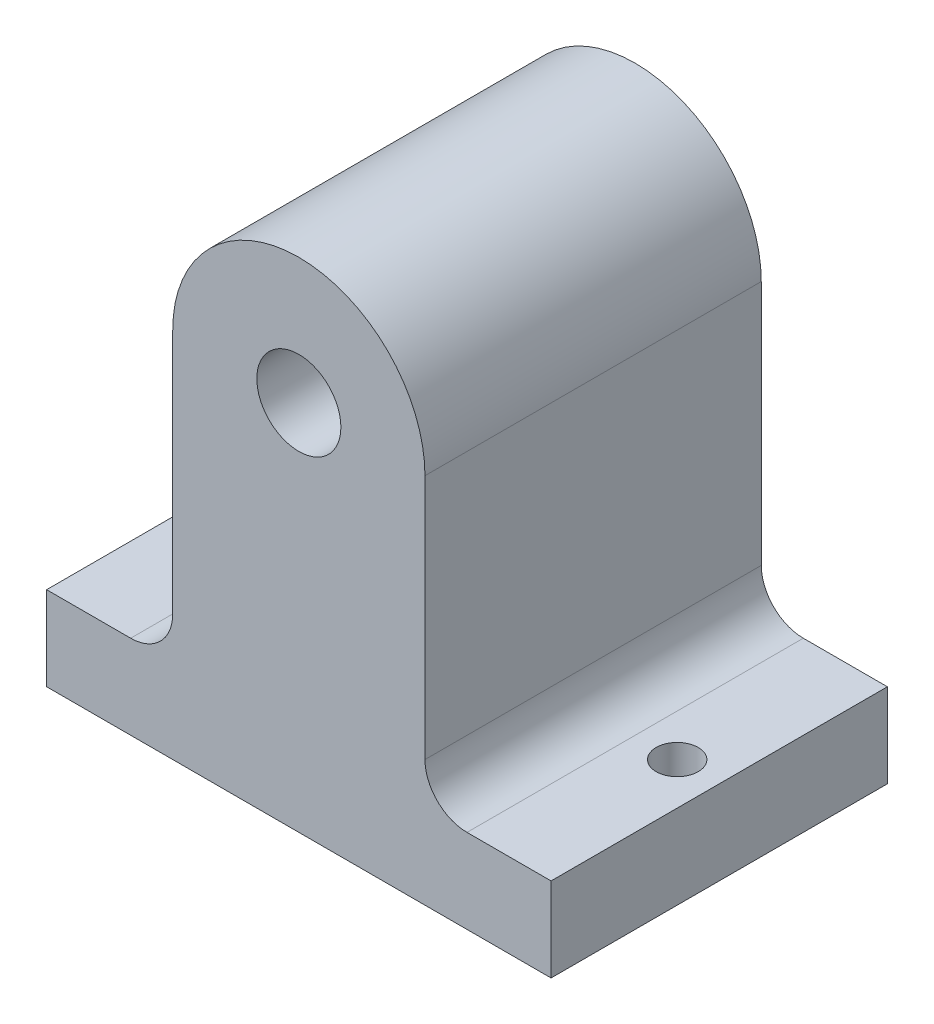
from build123d import *

# Parameters (mm, degrees)
SKETCH1_R           = 9.525
SKETCH1_R_2         = 3.175
SKETCH1_W           = 19.05
SKETCH1_H           = 6.35
SKETCH1_W_2         = 9.525
BOSS_EXTRUDE1_DEPTH = 25.4
FILLET1_R           = 3.175
SKETCH2_R           = 1.5875
CUT_EXTRUDE1_DEPTH  = 25.4


with BuildPart() as part:
    # Sketch1 → Boss-Extrude1 (new body)
    # profile 1 of 5: a face of its own
    with BuildSketch(Plane.XY):
        Circle(SKETCH1_R)
        Circle(SKETCH1_R_2, mode=Mode.SUBTRACT)
    # profile 2 of 5: a face of its own
    with BuildSketch(Plane.XY):
        with BuildLine():
            ThreePointArc((9.525, 0), (0, -9.525), (-9.525, 0))
            Line((-9.525, 0), (-9.525, -21.740900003))
            Line((-9.525, -21.740900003), (9.525, -21.740900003))
            Line((9.525, -21.740900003), (9.525, 0))
        make_face()
    # profile 3 of 5: a face of its own
    with BuildSketch(Plane.XY):
        with Locations((0, -24.915900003)):
            Rectangle(SKETCH1_W, SKETCH1_H)
    # profile 4 of 5: a face of its own
    with BuildSketch(Plane.XY):
        with Locations((-14.2875, -24.915900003)):
            Rectangle(SKETCH1_W_2, SKETCH1_H)
    # profile 5 of 5: a face of its own
    with BuildSketch(Plane.XY):
        with Locations((14.2875, -24.915900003)):
            Rectangle(SKETCH1_W_2, SKETCH1_H)
    extrude(amount=BOSS_EXTRUDE1_DEPTH)

    # Fillet1
    fillet1_edges = [part.edges().sort_by_distance(p)[0] for p in [
        (9.525, -21.740900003, 12.7),
        (-9.525, -21.740900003, 12.7),
    ]]
    fillet(fillet1_edges, radius=FILLET1_R)

    # Sketch2 → Cut-Extrude1 (cut)
    with BuildSketch(Plane(origin=(0, -21.740900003, 0), x_dir=(1, 0, 0), z_dir=(0, 1, 0))):
        with Locations(Location((-15.875, -12.7, 0), (0, 0, 270))):
            Circle(SKETCH2_R)
        with Locations(Location((15.875, -12.7, 0), (0, 0, 270))):
            Circle(SKETCH2_R)
    extrude(amount=-CUT_EXTRUDE1_DEPTH, mode=Mode.SUBTRACT)


solid = part.part
